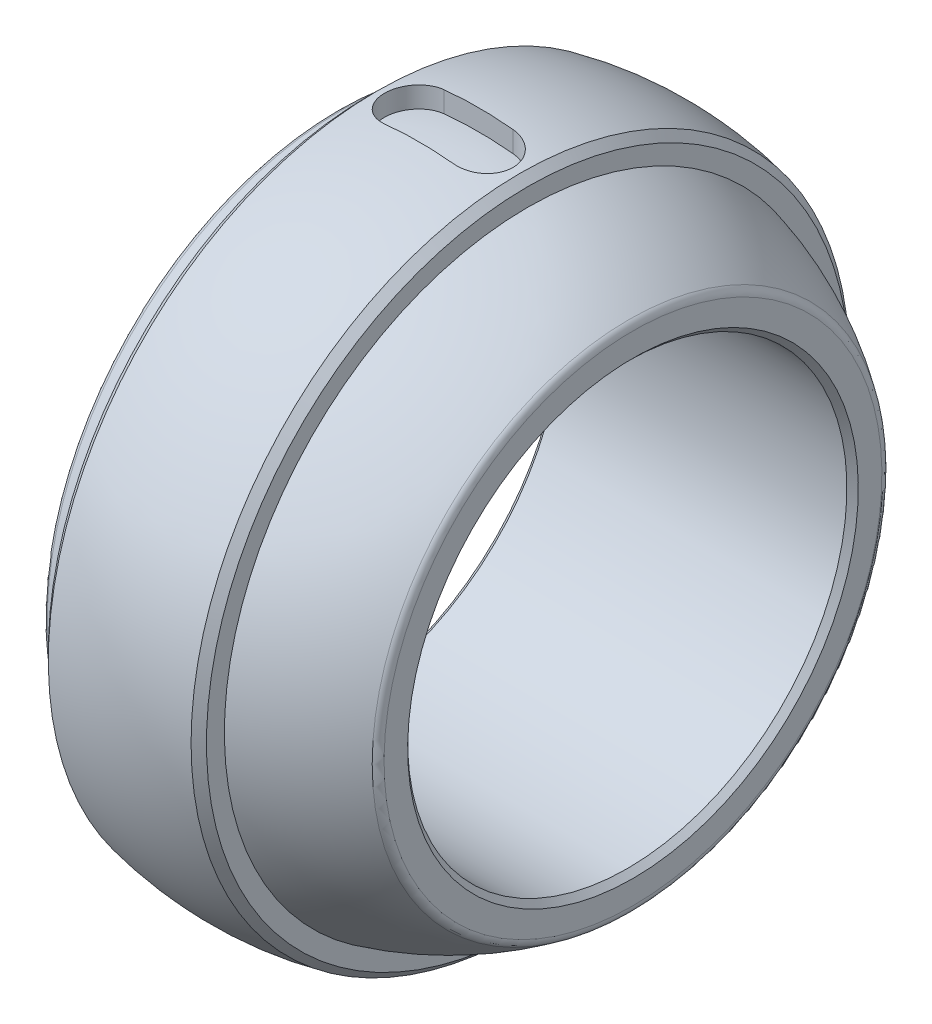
ISO-10303-21;
HEADER;
FILE_DESCRIPTION(('STEP AP214'),'2;1');
FILE_NAME('part.step','',(''),(''),'','','');
FILE_SCHEMA(('AUTOMOTIVE_DESIGN { 1 0 10303 214 1 1 1 1 }'));
ENDSEC;
DATA;
#1=APPLICATION_CONTEXT('core data for automotive mechanical design processes');
#2=APPLICATION_PROTOCOL_DEFINITION('international standard','automotive_design',2000,#1);
#3=PRODUCT_CONTEXT('',#1,'mechanical');
#4=PRODUCT('Part','Part','',(#3));
#5=PRODUCT_RELATED_PRODUCT_CATEGORY('part','',(#4));
#6=PRODUCT_DEFINITION_FORMATION('','',#4);
#7=PRODUCT_DEFINITION_CONTEXT('part definition',#1,'design');
#8=PRODUCT_DEFINITION('design','',#6,#7);
#9=PRODUCT_DEFINITION_SHAPE('','',#8);
#10=(LENGTH_UNIT() NAMED_UNIT(*) SI_UNIT(.MILLI.,.METRE.));
#11=(NAMED_UNIT(*) PLANE_ANGLE_UNIT() SI_UNIT($,.RADIAN.));
#12=(NAMED_UNIT(*) SI_UNIT($,.STERADIAN.) SOLID_ANGLE_UNIT());
#13=UNCERTAINTY_MEASURE_WITH_UNIT(LENGTH_MEASURE(1.E-05),#10,'distance_accuracy_value','');
#14=(GEOMETRIC_REPRESENTATION_CONTEXT(3) GLOBAL_UNCERTAINTY_ASSIGNED_CONTEXT((#13)) GLOBAL_UNIT_ASSIGNED_CONTEXT((#10,
#11,#12)) REPRESENTATION_CONTEXT('',''));
#15=CARTESIAN_POINT('',(0.,0.,0.));
#16=DIRECTION('',(0.,0.,1.));
#17=DIRECTION('',(1.,0.,0.));
#18=AXIS2_PLACEMENT_3D('',#15,#16,#17);
#19=CARTESIAN_POINT('',(0.,0.,0.));
#20=DIRECTION('',(-1.,0.,0.));
#21=DIRECTION('',(0.,1.,0.));
#22=AXIS2_PLACEMENT_3D('',#19,#20,#21);
#23=SPHERICAL_SURFACE('',#22,44.99991);
#24=CARTESIAN_POINT('',(9.53666015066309,0.,0.));
#25=DIRECTION('',(-1.,0.,0.));
#26=DIRECTION('',(0.,-1.,0.));
#27=AXIS2_PLACEMENT_3D('',#24,#25,#26);
#28=CIRCLE('',#27,43.9777672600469);
#29=CARTESIAN_POINT('',(9.53666015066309,-43.9777672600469,0.));
#30=VERTEX_POINT('',#29);
#31=EDGE_CURVE('E245',#30,#30,#28,.T.);
#32=ORIENTED_EDGE('',*,*,#31,.T.);
#33=EDGE_LOOP('',(#32));
#34=FACE_BOUND('',#33,.T.);
#35=CARTESIAN_POINT('',(-9.53666015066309,0.,0.));
#36=DIRECTION('',(1.,0.,0.));
#37=DIRECTION('',(0.,1.,0.));
#38=AXIS2_PLACEMENT_3D('',#35,#36,#37);
#39=CIRCLE('',#38,43.9777672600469);
#40=CARTESIAN_POINT('',(-9.53666015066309,43.9777672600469,0.));
#41=VERTEX_POINT('',#40);
#42=EDGE_CURVE('E248',#41,#41,#39,.T.);
#43=ORIENTED_EDGE('',*,*,#42,.T.);
#44=EDGE_LOOP('',(#43));
#45=FACE_BOUND('',#44,.T.);
#46=CARTESIAN_POINT('',(-4.6228,44.585542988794,3.96875));
#47=CARTESIAN_POINT('',(-2.31757744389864,44.8245287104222,3.96875));
#48=CARTESIAN_POINT('',(0.,44.8245571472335,3.96875));
#49=CARTESIAN_POINT('',(2.31702891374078,44.8245855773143,3.96875));
#50=CARTESIAN_POINT('',(4.6228,44.585542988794,3.96875));
#51=B_SPLINE_CURVE_WITH_KNOTS('',2,(#46,#47,#48,#49,#50),.UNSPECIFIED.,.F.,.F.,(3,2,3),(0.,0.5,
1.),.UNSPECIFIED.);
#52=CARTESIAN_POINT('',(-4.6228,44.585542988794,3.96875));
#53=VERTEX_POINT('',#52);
#54=CARTESIAN_POINT('',(4.6228,44.585542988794,3.96875));
#55=VERTEX_POINT('',#54);
#56=EDGE_CURVE('E35',#53,#55,#51,.T.);
#57=ORIENTED_EDGE('',*,*,#56,.F.);
#58=CARTESIAN_POINT('',(-4.6228,44.585542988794,-3.96875));
#59=CARTESIAN_POINT('',(-5.66861620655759,44.4771087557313,-3.96875));
#60=CARTESIAN_POINT('',(-6.69193026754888,44.3705549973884,-3.5415186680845));
#61=CARTESIAN_POINT('',(-8.15863813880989,44.2174802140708,-2.07882255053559));
#62=CARTESIAN_POINT('',(-8.59076220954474,44.1722135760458,-1.04077041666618));
#63=CARTESIAN_POINT('',(-8.59233551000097,44.1720489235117,1.03475358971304));
#64=CARTESIAN_POINT('',(-8.16880618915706,44.2164186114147,2.06752216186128));
#65=CARTESIAN_POINT('',(-6.6861604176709,44.3711575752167,3.54842945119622));
#66=CARTESIAN_POINT('',(-5.66862625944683,44.4771077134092,3.96875));
#67=CARTESIAN_POINT('',(-4.6228,44.585542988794,3.96875));
#68=B_SPLINE_CURVE_WITH_KNOTS('',3,(#58,#59,#60,#61,#62,#63,#64,#65,#66,#67),.UNSPECIFIED.,.F.,
.F.,(4,2,2,2,4),(0.,0.25,0.5,0.75,1.),.UNSPECIFIED.);
#69=CARTESIAN_POINT('',(-4.6228,44.585542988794,-3.96875));
#70=VERTEX_POINT('',#69);
#71=EDGE_CURVE('E94',#70,#53,#68,.T.);
#72=ORIENTED_EDGE('',*,*,#71,.F.);
#73=CARTESIAN_POINT('',(4.6228,44.585542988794,-3.96875));
#74=CARTESIAN_POINT('',(2.3175774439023,44.8245287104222,-3.96875));
#75=CARTESIAN_POINT('',(0.,44.8245571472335,-3.96875));
#76=CARTESIAN_POINT('',(-2.31702891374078,44.8245855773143,-3.96875));
#77=CARTESIAN_POINT('',(-4.6228,44.585542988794,-3.96875));
#78=B_SPLINE_CURVE_WITH_KNOTS('',2,(#73,#74,#75,#76,#77),.UNSPECIFIED.,.F.,.F.,(3,2,3),(0.,0.5,
1.),.UNSPECIFIED.);
#79=CARTESIAN_POINT('',(4.6228,44.585542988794,-3.96875));
#80=VERTEX_POINT('',#79);
#81=EDGE_CURVE('E78',#80,#70,#78,.T.);
#82=ORIENTED_EDGE('',*,*,#81,.F.);
#83=CARTESIAN_POINT('',(4.6228,44.585542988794,3.96875));
#84=CARTESIAN_POINT('',(5.66861620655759,44.4771087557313,3.96875));
#85=CARTESIAN_POINT('',(6.69193026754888,44.3705549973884,3.5415186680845));
#86=CARTESIAN_POINT('',(8.15863813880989,44.2174802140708,2.07882255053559));
#87=CARTESIAN_POINT('',(8.59076220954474,44.1722135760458,1.04077041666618));
#88=CARTESIAN_POINT('',(8.59233551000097,44.1720489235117,-1.03475358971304));
#89=CARTESIAN_POINT('',(8.16880618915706,44.2164186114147,-2.06752216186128));
#90=CARTESIAN_POINT('',(6.6861604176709,44.3711575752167,-3.54842945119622));
#91=CARTESIAN_POINT('',(5.66862625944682,44.4771077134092,-3.96875));
#92=CARTESIAN_POINT('',(4.6228,44.585542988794,-3.96875));
#93=B_SPLINE_CURVE_WITH_KNOTS('',3,(#83,#84,#85,#86,#87,#88,#89,#90,#91,#92),.UNSPECIFIED.,.F.,
.F.,(4,2,2,2,4),(0.,0.25,0.5,0.75,1.),.UNSPECIFIED.);
#94=EDGE_CURVE('E77',#55,#80,#93,.T.);
#95=ORIENTED_EDGE('',*,*,#94,.F.);
#96=EDGE_LOOP('',(#57,#72,#82,#95));
#97=FACE_BOUND('',#96,.T.);
#98=ADVANCED_FACE('F16',(#34,#45,#97),#23,.T.);
#99=CARTESIAN_POINT('',(0.,0.,0.));
#100=DIRECTION('',(-1.,0.,0.));
#101=DIRECTION('',(0.,1.,0.));
#102=AXIS2_PLACEMENT_3D('',#99,#100,#101);
#103=SPHERICAL_SURFACE('',#102,41.91);
#104=CARTESIAN_POINT('',(-14.2494,0.,0.));
#105=DIRECTION('',(1.,0.,0.));
#106=DIRECTION('',(0.,1.,0.));
#107=AXIS2_PLACEMENT_3D('',#104,#105,#106);
#108=CIRCLE('',#107,39.4132300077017);
#109=CARTESIAN_POINT('',(-14.2494,39.4132300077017,0.));
#110=VERTEX_POINT('',#109);
#111=EDGE_CURVE('E233',#110,#110,#108,.T.);
#112=CARTESIAN_POINT('',(-10.5664,0.,0.));
#113=DIRECTION('',(-1.,0.,0.));
#114=DIRECTION('',(0.,-1.,0.));
#115=AXIS2_PLACEMENT_3D('',#112,#113,#114);
#116=CIRCLE('',#115,40.556125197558);
#117=CARTESIAN_POINT('',(-10.5664,40.556125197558,0.));
#118=VERTEX_POINT('',#117);
#119=EDGE_CURVE('E219',#118,#118,#116,.T.);
#120=CARTESIAN_POINT('',(-14.2494,39.4132300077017,0.));
#121=CARTESIAN_POINT('',(-14.2116104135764,39.4268923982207,0.));
#122=CARTESIAN_POINT('',(-14.1738011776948,39.4405004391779,0.));
#123=CARTESIAN_POINT('',(-14.098143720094,39.467607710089,0.));
#124=CARTESIAN_POINT('',(-14.0602954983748,39.4811069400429,0.));
#125=CARTESIAN_POINT('',(-13.9845603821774,39.5079964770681,0.));
#126=CARTESIAN_POINT('',(-13.9466734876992,39.5213867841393,0.));
#127=CARTESIAN_POINT('',(-13.8708613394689,39.5480583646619,0.));
#128=CARTESIAN_POINT('',(-13.8329360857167,39.5613396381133,0.));
#129=CARTESIAN_POINT('',(-13.7570475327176,39.5877930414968,0.));
#130=CARTESIAN_POINT('',(-13.7190842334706,39.6009651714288,0.));
#131=CARTESIAN_POINT('',(-13.6431199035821,39.6272001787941,0.));
#132=CARTESIAN_POINT('',(-13.6051188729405,39.6402630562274,0.));
#133=CARTESIAN_POINT('',(-13.5290793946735,39.6662794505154,0.));
#134=CARTESIAN_POINT('',(-13.4910409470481,39.6792329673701,0.));
#135=CARTESIAN_POINT('',(-13.414926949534,39.7050305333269,0.));
#136=CARTESIAN_POINT('',(-13.3768513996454,39.717874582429,0.));
#137=CARTESIAN_POINT('',(-13.3006635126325,39.7434531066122,0.));
#138=CARTESIAN_POINT('',(-13.2625511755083,39.7561875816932,0.));
#139=CARTESIAN_POINT('',(-13.1862900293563,39.7815468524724,0.));
#140=CARTESIAN_POINT('',(-13.1481412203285,39.7941716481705,0.));
#141=CARTESIAN_POINT('',(-13.071807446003,39.8193114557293,0.));
#142=CARTESIAN_POINT('',(-13.0336224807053,39.8318264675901,0.));
#143=CARTESIAN_POINT('',(-12.957216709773,39.8567466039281,0.));
#144=CARTESIAN_POINT('',(-12.9189959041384,39.8691517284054,0.));
#145=CARTESIAN_POINT('',(-12.8425187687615,39.8938519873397,0.));
#146=CARTESIAN_POINT('',(-12.8042624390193,39.9061471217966,0.));
#147=CARTESIAN_POINT('',(-12.7277145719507,39.9306272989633,0.));
#148=CARTESIAN_POINT('',(-12.6894230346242,39.942812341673,0.));
#149=CARTESIAN_POINT('',(-12.6128050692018,39.9670722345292,0.));
#150=CARTESIAN_POINT('',(-12.5744786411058,39.9791470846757,0.));
#151=CARTESIAN_POINT('',(-12.4977912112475,40.0031864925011,0.));
#152=CARTESIAN_POINT('',(-12.4594302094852,40.01515105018,0.));
#153=CARTESIAN_POINT('',(-12.3826739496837,40.0389697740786,0.));
#154=CARTESIAN_POINT('',(-12.3442786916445,40.0508239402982,0.));
#155=CARTESIAN_POINT('',(-12.267454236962,40.0744217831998,0.));
#156=CARTESIAN_POINT('',(-12.2290250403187,40.0861654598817,0.));
#157=CARTESIAN_POINT('',(-12.1521330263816,40.1095422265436,0.));
#158=CARTESIAN_POINT('',(-12.1136702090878,40.1211753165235,0.));
#159=CARTESIAN_POINT('',(-12.0367112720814,40.1443308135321,0.));
#160=CARTESIAN_POINT('',(-11.9982151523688,40.1558532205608,0.));
#161=CARTESIAN_POINT('',(-11.9211899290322,40.1787872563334,0.));
#162=CARTESIAN_POINT('',(-11.8826608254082,40.1901988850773,0.));
#163=CARTESIAN_POINT('',(-11.8055699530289,40.2129112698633,0.));
#164=CARTESIAN_POINT('',(-11.7670081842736,40.2242120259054,0.));
#165=CARTESIAN_POINT('',(-11.6898523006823,40.2467025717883,0.));
#166=CARTESIAN_POINT('',(-11.6512581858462,40.257892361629,0.));
#167=CARTESIAN_POINT('',(-11.5740379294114,40.2801608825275,0.));
#168=CARTESIAN_POINT('',(-11.5354117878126,40.2912396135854,0.));
#169=CARTESIAN_POINT('',(-11.4581277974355,40.3132859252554,0.));
#170=CARTESIAN_POINT('',(-11.4194699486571,40.3242535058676,0.));
#171=CARTESIAN_POINT('',(-11.3421228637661,40.3460774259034,0.));
#172=CARTESIAN_POINT('',(-11.3034336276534,40.3569337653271,0.));
#173=CARTESIAN_POINT('',(-11.226024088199,40.3785351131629,0.));
#174=CARTESIAN_POINT('',(-11.1873037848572,40.389280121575,0.));
#175=CARTESIAN_POINT('',(-11.1098324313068,40.4106587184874,0.));
#176=CARTESIAN_POINT('',(-11.0710813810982,40.4212923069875,0.));
#177=CARTESIAN_POINT('',(-10.9935488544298,40.4424479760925,0.));
#178=CARTESIAN_POINT('',(-10.95476737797,40.4529700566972,0.));
#179=CARTESIAN_POINT('',(-10.877174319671,40.4739026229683,0.));
#180=CARTESIAN_POINT('',(-10.8383627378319,40.4843131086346,0.));
#181=CARTESIAN_POINT('',(-10.760709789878,40.5050223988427,0.));
#182=CARTESIAN_POINT('',(-10.7218684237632,40.5153212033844,0.));
#183=CARTESIAN_POINT('',(-10.6441562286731,40.535807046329,0.));
#184=CARTESIAN_POINT('',(-10.6052853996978,40.5459940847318,0.));
#185=CARTESIAN_POINT('',(-10.5664,40.556125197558,0.));
#186=B_SPLINE_CURVE_WITH_KNOTS('',3,(#120,#121,#122,#123,#124,#125,#126,#127,#128,#129,#130,
#131,#132,#133,#134,#135,#136,#137,#138,#139,#140,#141,#142,#143,#144,#145,#146,#147,#148,#149,
#150,#151,#152,#153,#154,#155,#156,#157,#158,#159,#160,#161,#162,#163,#164,#165,#166,#167,#168,
#169,#170,#171,#172,#173,#174,#175,#176,#177,#178,#179,#180,#181,#182,#183,#184,#185),
.UNSPECIFIED.,.F.,.F.,(4,2,2,2,2,2,2,2,2,2,2,2,2,2,2,2,2,2,2,2,2,2,2,2,2,2,2,2,2,2,2,2,4),(0.,
0.120550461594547,0.241100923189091,0.361651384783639,0.482201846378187,0.602752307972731,
0.72330276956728,0.843853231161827,0.964403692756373,1.08495415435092,1.20550461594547,
1.32605507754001,1.44660553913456,1.5671560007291,1.68770646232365,1.8082569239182,
1.92880738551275,2.04935784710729,2.16990830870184,2.29045877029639,2.41100923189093,
2.53155969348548,2.65211015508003,2.77266061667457,2.89321107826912,3.01376153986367,
3.13431200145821,3.25486246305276,3.37541292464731,3.49596338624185,3.6165138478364,
3.73706430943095,3.85761477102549),.UNSPECIFIED.);
#187=EDGE_CURVE('BSEAM18',#110,#118,#186,.T.);
#188=ORIENTED_EDGE('',*,*,#111,.T.);
#189=ORIENTED_EDGE('',*,*,#119,.T.);
#190=ORIENTED_EDGE('',*,*,#187,.T.);
#191=ORIENTED_EDGE('',*,*,#187,.F.);
#192=EDGE_LOOP('',(#188,#190,#189,#191));
#193=FACE_BOUND('',#192,.T.);
#194=ADVANCED_FACE('F18',(#193),#103,.T.);
#195=CARTESIAN_POINT('',(-15.0876,39.1000310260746,0.));
#196=DIRECTION('',(1.,0.,0.));
#197=DIRECTION('',(0.,1.,0.));
#198=AXIS2_PLACEMENT_3D('',#195,#196,#197);
#199=PLANE('',#198);
#200=CARTESIAN_POINT('',(-15.0876,0.,0.));
#201=DIRECTION('',(1.,0.,0.));
#202=DIRECTION('',(0.,1.,0.));
#203=AXIS2_PLACEMENT_3D('',#200,#201,#202);
#204=CIRCLE('',#203,30.1117);
#205=CARTESIAN_POINT('',(-15.0876,30.1117,0.));
#206=VERTEX_POINT('',#205);
#207=EDGE_CURVE('E27',#206,#206,#204,.T.);
#208=ORIENTED_EDGE('',*,*,#207,.T.);
#209=EDGE_LOOP('',(#208));
#210=FACE_BOUND('',#209,.T.);
#211=CARTESIAN_POINT('',(-15.0876,0.,0.));
#212=DIRECTION('',(1.,0.,0.));
#213=DIRECTION('',(0.,1.,0.));
#214=AXIS2_PLACEMENT_3D('',#211,#212,#213);
#215=CIRCLE('',#214,38.218889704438);
#216=CARTESIAN_POINT('',(-15.0876,38.218889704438,0.));
#217=VERTEX_POINT('',#216);
#218=EDGE_CURVE('E230',#217,#217,#215,.F.);
#219=ORIENTED_EDGE('',*,*,#218,.T.);
#220=EDGE_LOOP('',(#219));
#221=FACE_BOUND('',#220,.T.);
#222=ADVANCED_FACE('F404',(#210,#221),#199,.F.);
#223=CARTESIAN_POINT('',(24.6126,0.,0.));
#224=DIRECTION('',(-1.,0.,0.));
#225=DIRECTION('',(0.,-1.,0.));
#226=AXIS2_PLACEMENT_3D('',#223,#224,#225);
#227=PLANE('',#226);
#228=CARTESIAN_POINT('',(24.6126,0.,0.));
#229=DIRECTION('',(-1.,0.,0.));
#230=DIRECTION('',(0.,-1.,0.));
#231=AXIS2_PLACEMENT_3D('',#228,#229,#230);
#232=CIRCLE('',#231,30.1117);
#233=CARTESIAN_POINT('',(24.6126,-30.1117,0.));
#234=VERTEX_POINT('',#233);
#235=EDGE_CURVE('E10',#234,#234,#232,.T.);
#236=ORIENTED_EDGE('',*,*,#235,.T.);
#237=EDGE_LOOP('',(#236));
#238=FACE_BOUND('',#237,.T.);
#239=CARTESIAN_POINT('',(24.6126,0.,0.));
#240=DIRECTION('',(-1.,0.,0.));
#241=DIRECTION('',(0.,-1.,0.));
#242=AXIS2_PLACEMENT_3D('',#239,#240,#241);
#243=CIRCLE('',#242,33.2675912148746);
#244=CARTESIAN_POINT('',(24.6126,-33.2675912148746,0.));
#245=VERTEX_POINT('',#244);
#246=EDGE_CURVE('E239',#245,#245,#243,.F.);
#247=ORIENTED_EDGE('',*,*,#246,.T.);
#248=EDGE_LOOP('',(#247));
#249=FACE_BOUND('',#248,.T.);
#250=ADVANCED_FACE('F396',(#238,#249),#227,.F.);
#251=CARTESIAN_POINT('',(0.,0.,0.));
#252=DIRECTION('',(-1.,0.,0.));
#253=DIRECTION('',(0.,1.,0.));
#254=AXIS2_PLACEMENT_3D('',#251,#252,#253);
#255=SPHERICAL_SURFACE('',#254,41.91);
#256=CARTESIAN_POINT('',(24.07205625,0.,0.));
#257=DIRECTION('',(-1.,0.,0.));
#258=DIRECTION('',(0.,-1.,0.));
#259=AXIS2_PLACEMENT_3D('',#256,#257,#258);
#260=CIRCLE('',#259,34.3072034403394);
#261=CARTESIAN_POINT('',(24.07205625,34.3072034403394,0.));
#262=VERTEX_POINT('',#261);
#263=EDGE_CURVE('E236',#262,#262,#260,.T.);
#264=CARTESIAN_POINT('',(10.5664,0.,0.));
#265=DIRECTION('',(-1.,0.,0.));
#266=DIRECTION('',(0.,-1.,0.));
#267=AXIS2_PLACEMENT_3D('',#264,#265,#266);
#268=CIRCLE('',#267,40.556125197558);
#269=CARTESIAN_POINT('',(10.5664,40.556125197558,0.));
#270=VERTEX_POINT('',#269);
#271=EDGE_CURVE('E227',#270,#270,#268,.T.);
#272=CARTESIAN_POINT('',(24.07205625,34.3072034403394,0.));
#273=CARTESIAN_POINT('',(23.9444875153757,34.396713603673,0.));
#274=CARTESIAN_POINT('',(23.8164194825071,34.4855121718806,0.));
#275=CARTESIAN_POINT('',(23.5593008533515,34.6616752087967,0.));
#276=CARTESIAN_POINT('',(23.4302502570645,34.7490396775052,0.));
#277=CARTESIAN_POINT('',(23.1711825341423,34.9223236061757,0.));
#278=CARTESIAN_POINT('',(23.0411654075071,35.0082430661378,0.));
#279=CARTESIAN_POINT('',(22.7801808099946,35.1786262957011,0.));
#280=CARTESIAN_POINT('',(22.6492133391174,35.2630900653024,0.));
#281=CARTESIAN_POINT('',(22.3863443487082,35.4305514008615,0.));
#282=CARTESIAN_POINT('',(22.2544428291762,35.5135489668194,0.));
#283=CARTESIAN_POINT('',(21.9897221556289,35.678067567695,0.));
#284=CARTESIAN_POINT('',(21.8569030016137,35.7595886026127,0.));
#285=CARTESIAN_POINT('',(21.5903635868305,35.921143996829,0.));
#286=CARTESIAN_POINT('',(21.4566433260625,36.0011783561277,0.));
#287=CARTESIAN_POINT('',(21.1883183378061,36.1597504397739,0.));
#288=CARTESIAN_POINT('',(21.0537136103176,36.2382881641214,0.));
#289=CARTESIAN_POINT('',(20.7836364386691,36.3938572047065,0.));
#290=CARTESIAN_POINT('',(20.648163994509,36.4708885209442,0.));
#291=CARTESIAN_POINT('',(20.376368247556,36.6234351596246,0.));
#292=CARTESIAN_POINT('',(20.2400449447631,36.6989504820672,0.));
#293=CARTESIAN_POINT('',(19.9665644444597,36.848455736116,0.));
#294=CARTESIAN_POINT('',(19.8294072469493,36.9224456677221,0.));
#295=CARTESIAN_POINT('',(19.5542760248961,37.0688909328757,0.));
#296=CARTESIAN_POINT('',(19.4163020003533,37.141346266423,0.));
#297=CARTESIAN_POINT('',(19.1395542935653,37.2847133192,0.));
#298=CARTESIAN_POINT('',(19.00078061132,37.3556250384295,0.));
#299=CARTESIAN_POINT('',(18.7224508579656,37.4958960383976,0.));
#300=CARTESIAN_POINT('',(18.5828947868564,37.5652553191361,0.));
#301=CARTESIAN_POINT('',(18.3030176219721,37.7024128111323,0.));
#302=CARTESIAN_POINT('',(18.162696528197,37.7702110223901,0.));
#303=CARTESIAN_POINT('',(17.8813067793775,37.9042379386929,0.));
#304=CARTESIAN_POINT('',(17.740238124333,37.970466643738,0.));
#305=CARTESIAN_POINT('',(17.4573708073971,38.1013463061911,0.));
#306=CARTESIAN_POINT('',(17.3155721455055,38.1659972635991,0.));
#307=CARTESIAN_POINT('',(17.0312624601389,38.2937133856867,0.));
#308=CARTESIAN_POINT('',(16.8887514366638,38.3567785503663,0.));
#309=CARTESIAN_POINT('',(16.6030347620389,38.4813152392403,0.));
#310=CARTESIAN_POINT('',(16.4598291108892,38.5427867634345,0.));
#311=CARTESIAN_POINT('',(16.1727410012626,38.6641285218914,0.));
#312=CARTESIAN_POINT('',(16.0288585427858,38.7239987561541,0.));
#313=CARTESIAN_POINT('',(15.7404347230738,38.8421304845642,0.));
#314=CARTESIAN_POINT('',(15.5958933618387,38.9003919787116,0.));
#315=CARTESIAN_POINT('',(15.3061697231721,39.0152989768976,0.));
#316=CARTESIAN_POINT('',(15.1609874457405,39.0719444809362,0.));
#317=CARTESIAN_POINT('',(14.8700000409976,39.1836124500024,0.));
#318=CARTESIAN_POINT('',(14.7241949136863,39.23863491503,0.));
#319=CARTESIAN_POINT('',(14.4319799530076,39.3470499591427,0.));
#320=CARTESIAN_POINT('',(14.2855701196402,39.4004425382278,0.));
#321=CARTESIAN_POINT('',(13.9921639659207,39.5055911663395,0.));
#322=CARTESIAN_POINT('',(13.8451676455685,39.5573472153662,0.));
#323=CARTESIAN_POINT('',(13.550606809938,39.6592163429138,0.));
#324=CARTESIAN_POINT('',(13.4030422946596,39.7093294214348,0.));
#325=CARTESIAN_POINT('',(13.1073634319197,39.8079063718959,0.));
#326=CARTESIAN_POINT('',(12.9592490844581,39.856370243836,0.));
#327=CARTESIAN_POINT('',(12.6624889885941,39.9516427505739,0.));
#328=CARTESIAN_POINT('',(12.5138432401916,39.9984513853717,0.));
#329=CARTESIAN_POINT('',(12.2160388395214,40.0904075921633,0.));
#330=CARTESIAN_POINT('',(12.0668801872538,40.1355551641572,0.));
#331=CARTESIAN_POINT('',(11.7680685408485,40.2241836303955,0.));
#332=CARTESIAN_POINT('',(11.6184155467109,40.2676645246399,0.));
#333=CARTESIAN_POINT('',(11.318633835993,40.3529542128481,0.));
#334=CARTESIAN_POINT('',(11.1685051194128,40.3947630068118,0.));
#335=CARTESIAN_POINT('',(10.8677906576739,40.4767033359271,0.));
#336=CARTESIAN_POINT('',(10.7172049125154,40.5168348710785,0.));
#337=CARTESIAN_POINT('',(10.5664,40.556125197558,0.));
#338=B_SPLINE_CURVE_WITH_KNOTS('',3,(#272,#273,#274,#275,#276,#277,#278,#279,#280,#281,#282,
#283,#284,#285,#286,#287,#288,#289,#290,#291,#292,#293,#294,#295,#296,#297,#298,#299,#300,#301,
#302,#303,#304,#305,#306,#307,#308,#309,#310,#311,#312,#313,#314,#315,#316,#317,#318,#319,#320,
#321,#322,#323,#324,#325,#326,#327,#328,#329,#330,#331,#332,#333,#334,#335,#336,#337),
.UNSPECIFIED.,.F.,.F.,(4,2,2,2,2,2,2,2,2,2,2,2,2,2,2,2,2,2,2,2,2,2,2,2,2,2,2,2,2,2,2,2,4),(0.,
0.467515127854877,0.935030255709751,1.40254538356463,1.87006051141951,2.33757563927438,
2.80509076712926,3.27260589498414,3.74012102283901,4.20763615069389,4.67515127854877,
5.14266640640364,5.61018153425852,6.0776966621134,6.54521178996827,7.01272691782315,
7.48024204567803,7.9477571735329,8.41527230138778,8.88278742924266,9.35030255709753,
9.81781768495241,10.2853328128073,10.7528479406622,11.220363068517,11.6878781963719,
12.1553933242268,12.6229084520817,13.0904235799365,13.5579387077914,14.0254538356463,
14.4929689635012,14.9604840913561),.UNSPECIFIED.);
#339=EDGE_CURVE('BSEAM388',#262,#270,#338,.T.);
#340=ORIENTED_EDGE('',*,*,#263,.T.);
#341=ORIENTED_EDGE('',*,*,#271,.F.);
#342=ORIENTED_EDGE('',*,*,#339,.T.);
#343=ORIENTED_EDGE('',*,*,#339,.F.);
#344=EDGE_LOOP('',(#340,#342,#341,#343));
#345=FACE_BOUND('',#344,.T.);
#346=ADVANCED_FACE('F388',(#345),#255,.T.);
#347=CARTESIAN_POINT('',(10.5664,43.74177741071,0.));
#348=DIRECTION('',(-1.,0.,0.));
#349=DIRECTION('',(0.,-1.,0.));
#350=AXIS2_PLACEMENT_3D('',#347,#348,#349);
#351=PLANE('',#350);
#352=CARTESIAN_POINT('',(10.5664,0.,0.));
#353=DIRECTION('',(-1.,0.,0.));
#354=DIRECTION('',(0.,-1.,0.));
#355=AXIS2_PLACEMENT_3D('',#352,#353,#354);
#356=CIRCLE('',#355,42.94802741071);
#357=CARTESIAN_POINT('',(10.5664,-42.94802741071,0.));
#358=VERTEX_POINT('',#357);
#359=EDGE_CURVE('E251',#358,#358,#356,.F.);
#360=ORIENTED_EDGE('',*,*,#359,.T.);
#361=EDGE_LOOP('',(#360));
#362=FACE_BOUND('',#361,.T.);
#363=ORIENTED_EDGE('',*,*,#271,.T.);
#364=EDGE_LOOP('',(#363));
#365=FACE_BOUND('',#364,.T.);
#366=ADVANCED_FACE('F280',(#362,#365),#351,.F.);
#367=CARTESIAN_POINT('',(-10.5664,43.74177741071,0.));
#368=DIRECTION('',(1.,0.,0.));
#369=DIRECTION('',(0.,1.,0.));
#370=AXIS2_PLACEMENT_3D('',#367,#368,#369);
#371=PLANE('',#370);
#372=CARTESIAN_POINT('',(-10.5664,0.,0.));
#373=DIRECTION('',(1.,0.,0.));
#374=DIRECTION('',(0.,1.,0.));
#375=AXIS2_PLACEMENT_3D('',#372,#373,#374);
#376=CIRCLE('',#375,42.94802741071);
#377=CARTESIAN_POINT('',(-10.5664,42.94802741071,0.));
#378=VERTEX_POINT('',#377);
#379=EDGE_CURVE('E242',#378,#378,#376,.F.);
#380=ORIENTED_EDGE('',*,*,#379,.T.);
#381=EDGE_LOOP('',(#380));
#382=FACE_BOUND('',#381,.T.);
#383=ORIENTED_EDGE('',*,*,#119,.F.);
#384=EDGE_LOOP('',(#383));
#385=FACE_BOUND('',#384,.T.);
#386=ADVANCED_FACE('F278',(#382,#385),#371,.F.);
#387=CARTESIAN_POINT('',(-13.8176,0.,0.));
#388=DIRECTION('',(1.,0.,0.));
#389=DIRECTION('',(0.,1.,0.));
#390=AXIS2_PLACEMENT_3D('',#387,#388,#389);
#391=TOROIDAL_SURFACE('',#390,38.218889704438,1.27);
#392=ORIENTED_EDGE('',*,*,#111,.F.);
#393=EDGE_LOOP('',(#392));
#394=FACE_BOUND('',#393,.T.);
#395=ORIENTED_EDGE('',*,*,#218,.F.);
#396=EDGE_LOOP('',(#395));
#397=FACE_BOUND('',#396,.T.);
#398=ADVANCED_FACE('F365',(#394,#397),#391,.T.);
#399=CARTESIAN_POINT('',(23.3426,0.,0.));
#400=DIRECTION('',(-1.,0.,0.));
#401=DIRECTION('',(0.,-1.,0.));
#402=AXIS2_PLACEMENT_3D('',#399,#400,#401);
#403=TOROIDAL_SURFACE('',#402,33.2675912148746,1.27);
#404=ORIENTED_EDGE('',*,*,#246,.F.);
#405=EDGE_LOOP('',(#404));
#406=FACE_BOUND('',#405,.T.);
#407=ORIENTED_EDGE('',*,*,#263,.F.);
#408=EDGE_LOOP('',(#407));
#409=FACE_BOUND('',#408,.T.);
#410=ADVANCED_FACE('F356',(#406,#409),#403,.T.);
#411=CARTESIAN_POINT('',(-10.5664,0.,0.));
#412=DIRECTION('',(1.,0.,0.));
#413=DIRECTION('',(0.,1.,0.));
#414=AXIS2_PLACEMENT_3D('',#411,#412,#413);
#415=CONICAL_SURFACE('',#414,42.94802741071,0.785398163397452);
#416=ORIENTED_EDGE('',*,*,#42,.F.);
#417=EDGE_LOOP('',(#416));
#418=FACE_BOUND('',#417,.T.);
#419=ORIENTED_EDGE('',*,*,#379,.F.);
#420=EDGE_LOOP('',(#419));
#421=FACE_BOUND('',#420,.T.);
#422=ADVANCED_FACE('F347',(#418,#421),#415,.T.);
#423=CARTESIAN_POINT('',(9.53666015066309,0.,0.));
#424=DIRECTION('',(-1.,0.,0.));
#425=DIRECTION('',(0.,-1.,0.));
#426=AXIS2_PLACEMENT_3D('',#423,#424,#425);
#427=CONICAL_SURFACE('',#426,43.9777672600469,0.785398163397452);
#428=ORIENTED_EDGE('',*,*,#359,.F.);
#429=EDGE_LOOP('',(#428));
#430=FACE_BOUND('',#429,.T.);
#431=ORIENTED_EDGE('',*,*,#31,.F.);
#432=EDGE_LOOP('',(#431));
#433=FACE_BOUND('',#432,.T.);
#434=ADVANCED_FACE('F338',(#430,#433),#427,.T.);
#435=CARTESIAN_POINT('',(-15.0886,0.,0.));
#436=DIRECTION('',(1.,0.,0.));
#437=DIRECTION('',(0.,1.,0.));
#438=AXIS2_PLACEMENT_3D('',#435,#436,#437);
#439=CYLINDRICAL_SURFACE('',#438,29.3497);
#440=CARTESIAN_POINT('',(-14.3256,0.,0.));
#441=DIRECTION('',(1.,0.,0.));
#442=DIRECTION('',(0.,1.,0.));
#443=AXIS2_PLACEMENT_3D('',#440,#441,#442);
#444=CIRCLE('',#443,29.3497);
#445=CARTESIAN_POINT('',(-14.3256,29.3497,0.));
#446=VERTEX_POINT('',#445);
#447=EDGE_CURVE('E257',#446,#446,#444,.F.);
#448=ORIENTED_EDGE('',*,*,#447,.T.);
#449=EDGE_LOOP('',(#448));
#450=FACE_BOUND('',#449,.T.);
#451=CARTESIAN_POINT('',(23.8506,0.,0.));
#452=DIRECTION('',(-1.,0.,0.));
#453=DIRECTION('',(0.,-1.,0.));
#454=AXIS2_PLACEMENT_3D('',#451,#452,#453);
#455=CIRCLE('',#454,29.3497);
#456=CARTESIAN_POINT('',(23.8506,-29.3497,0.));
#457=VERTEX_POINT('',#456);
#458=EDGE_CURVE('E254',#457,#457,#455,.F.);
#459=ORIENTED_EDGE('',*,*,#458,.T.);
#460=EDGE_LOOP('',(#459));
#461=FACE_BOUND('',#460,.T.);
#462=ADVANCED_FACE('F329',(#450,#461),#439,.F.);
#463=CARTESIAN_POINT('',(-14.3256,0.,0.));
#464=DIRECTION('',(-1.,0.,0.));
#465=DIRECTION('',(0.,-1.,0.));
#466=AXIS2_PLACEMENT_3D('',#463,#464,#465);
#467=CONICAL_SURFACE('',#466,29.3497,0.785398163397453);
#468=ORIENTED_EDGE('',*,*,#207,.F.);
#469=EDGE_LOOP('',(#468));
#470=FACE_BOUND('',#469,.T.);
#471=ORIENTED_EDGE('',*,*,#447,.F.);
#472=EDGE_LOOP('',(#471));
#473=FACE_BOUND('',#472,.T.);
#474=ADVANCED_FACE('F321',(#470,#473),#467,.F.);
#475=CARTESIAN_POINT('',(23.8506,0.,0.));
#476=DIRECTION('',(1.,0.,0.));
#477=DIRECTION('',(0.,1.,0.));
#478=AXIS2_PLACEMENT_3D('',#475,#476,#477);
#479=CONICAL_SURFACE('',#478,29.3497,0.785398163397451);
#480=ORIENTED_EDGE('',*,*,#235,.F.);
#481=EDGE_LOOP('',(#480));
#482=FACE_BOUND('',#481,.T.);
#483=ORIENTED_EDGE('',*,*,#458,.F.);
#484=EDGE_LOOP('',(#483));
#485=FACE_BOUND('',#484,.T.);
#486=ADVANCED_FACE('F146',(#482,#485),#479,.F.);
#487=CARTESIAN_POINT('',(0.,-2.794,0.));
#488=DIRECTION('',(-1.,0.,0.));
#489=DIRECTION('',(0.,1.,0.));
#490=AXIS2_PLACEMENT_3D('',#487,#488,#489);
#491=SPHERICAL_SURFACE('',#490,44.99991);
#492=CARTESIAN_POINT('',(-4.6228,41.791542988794,3.96875));
#493=CARTESIAN_POINT('',(-4.24020748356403,41.8312128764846,3.96874952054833));
#494=CARTESIAN_POINT('',(-3.8571041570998,41.8659559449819,3.96874812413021));
#495=CARTESIAN_POINT('',(-3.08928350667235,41.9256362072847,3.96874554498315));
#496=CARTESIAN_POINT('',(-2.70456448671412,41.9505515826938,3.9687443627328));
#497=CARTESIAN_POINT('',(-1.93376161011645,41.990492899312,3.96874427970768));
#498=CARTESIAN_POINT('',(-1.54767661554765,42.0054968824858,3.96874538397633));
#499=CARTESIAN_POINT('',(-0.774394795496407,42.0255400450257,3.96874825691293));
#500=CARTESIAN_POINT('',(-0.387197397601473,42.0305571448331,3.96875002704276));
#501=CARTESIAN_POINT('',(0.387191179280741,42.0305571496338,3.96874997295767));
#502=CARTESIAN_POINT('',(0.774382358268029,42.0255402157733,3.96874814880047));
#503=CARTESIAN_POINT('',(1.54765589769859,42.00549759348,3.96874523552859));
#504=CARTESIAN_POINT('',(1.93373882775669,41.9904938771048,3.96874414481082));
#505=CARTESIAN_POINT('',(2.70454172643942,41.9505529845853,3.96874426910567));
#506=CARTESIAN_POINT('',(3.08926282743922,41.9256376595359,3.96874547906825));
#507=CARTESIAN_POINT('',(3.85709176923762,41.8659570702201,3.96874810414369));
#508=CARTESIAN_POINT('',(4.24020129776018,41.8312135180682,3.96874951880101));
#509=CARTESIAN_POINT('',(4.6228,41.791542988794,3.96875));
#510=B_SPLINE_CURVE_WITH_KNOTS('',3,(#492,#493,#494,#495,#496,#497,#498,#499,#500,#501,#502,
#503,#504,#505,#506,#507,#508,#509),.UNSPECIFIED.,.F.,.F.,(4,2,2,2,2,2,2,2,4),(0.,
1.15389906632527,2.31034566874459,3.46934578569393,4.63090545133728,5.79244646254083,
6.9514403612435,8.10789318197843,9.26181090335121),.UNSPECIFIED.);
#511=CARTESIAN_POINT('',(-4.6228,41.791542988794,3.96875));
#512=VERTEX_POINT('',#511);
#513=CARTESIAN_POINT('',(4.6228,41.791542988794,3.96875));
#514=VERTEX_POINT('',#513);
#515=EDGE_CURVE('E73',#512,#514,#510,.T.);
#516=ORIENTED_EDGE('',*,*,#515,.T.);
#517=CARTESIAN_POINT('',(4.6228,41.791542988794,-3.96875));
#518=CARTESIAN_POINT('',(5.66862625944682,41.6831077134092,-3.96875));
#519=CARTESIAN_POINT('',(6.6861604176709,41.5771575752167,-3.54842945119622));
#520=CARTESIAN_POINT('',(8.16880618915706,41.4224186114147,-2.06752216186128));
#521=CARTESIAN_POINT('',(8.59233551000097,41.3780489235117,-1.03475358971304));
#522=CARTESIAN_POINT('',(8.59076220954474,41.3782135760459,1.04077041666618));
#523=CARTESIAN_POINT('',(8.15863813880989,41.4234802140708,2.07882255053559));
#524=CARTESIAN_POINT('',(6.69193026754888,41.5765549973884,3.5415186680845));
#525=CARTESIAN_POINT('',(5.66861620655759,41.6831087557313,3.96875));
#526=CARTESIAN_POINT('',(4.6228,41.791542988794,3.96875));
#527=B_SPLINE_CURVE_WITH_KNOTS('',3,(#517,#518,#519,#520,#521,#522,#523,#524,#525,#526),
.UNSPECIFIED.,.F.,.F.,(4,2,2,2,4),(0.,0.25,0.5,0.75,1.),.UNSPECIFIED.);
#528=CARTESIAN_POINT('',(4.6228,41.791542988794,-3.96875));
#529=VERTEX_POINT('',#528);
#530=EDGE_CURVE('E69',#514,#529,#527,.F.);
#531=ORIENTED_EDGE('',*,*,#530,.T.);
#532=CARTESIAN_POINT('',(4.6228,41.791542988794,-3.96875));
#533=CARTESIAN_POINT('',(4.24020749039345,41.8312128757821,-3.96874952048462));
#534=CARTESIAN_POINT('',(3.8571041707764,41.8659559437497,-3.9687481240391));
#535=CARTESIAN_POINT('',(3.08928352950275,41.925636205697,-3.96874554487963));
#536=CARTESIAN_POINT('',(2.70456451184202,41.9505515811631,-3.96874436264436));
#537=CARTESIAN_POINT('',(1.93376163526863,41.9904928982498,-3.96874427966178));
#538=CARTESIAN_POINT('',(1.54767663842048,42.005496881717,-3.96874538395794));
#539=CARTESIAN_POINT('',(0.774394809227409,42.0255400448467,-3.96874825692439));
#540=CARTESIAN_POINT('',(0.387197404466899,42.0305571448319,-3.96875002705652));
#541=CARTESIAN_POINT('',(-0.387191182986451,42.030557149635,-3.96874997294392));
#542=CARTESIAN_POINT('',(-0.774382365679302,42.0255402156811,-3.96874814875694));
#543=CARTESIAN_POINT('',(-1.54765591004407,42.0054975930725,-3.9687452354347));
#544=CARTESIAN_POINT('',(-1.93373884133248,41.9904938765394,-3.96874414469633));
#545=CARTESIAN_POINT('',(-2.70454174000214,41.9505529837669,-3.96874426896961));
#546=CARTESIAN_POINT('',(-3.08926283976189,41.9256376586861,-3.96874547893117));
#547=CARTESIAN_POINT('',(-3.85709177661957,41.8659570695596,-3.96874810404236));
#548=CARTESIAN_POINT('',(-4.2402013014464,41.8312135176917,-3.96874951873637));
#549=CARTESIAN_POINT('',(-4.6228,41.791542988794,-3.96875));
#550=B_SPLINE_CURVE_WITH_KNOTS('',3,(#532,#533,#534,#535,#536,#537,#538,#539,#540,#541,#542,
#543,#544,#545,#546,#547,#548,#549),.UNSPECIFIED.,.F.,.F.,(4,2,2,2,2,2,2,2,4),(0.,
1.1538990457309,2.31034564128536,3.4693457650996,4.63090545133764,5.792446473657,
6.95144037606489,8.10789319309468,9.26181090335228),.UNSPECIFIED.);
#551=CARTESIAN_POINT('',(-4.6228,41.791542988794,-3.96875));
#552=VERTEX_POINT('',#551);
#553=EDGE_CURVE('E64',#529,#552,#550,.T.);
#554=ORIENTED_EDGE('',*,*,#553,.T.);
#555=CARTESIAN_POINT('',(-4.6228,41.791542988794,3.96875));
#556=CARTESIAN_POINT('',(-5.66862625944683,41.6831077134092,3.96875));
#557=CARTESIAN_POINT('',(-6.6861604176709,41.5771575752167,3.54842945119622));
#558=CARTESIAN_POINT('',(-8.16880618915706,41.4224186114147,2.06752216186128));
#559=CARTESIAN_POINT('',(-8.59233551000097,41.3780489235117,1.03475358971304));
#560=CARTESIAN_POINT('',(-8.59076220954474,41.3782135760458,-1.04077041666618));
#561=CARTESIAN_POINT('',(-8.15863813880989,41.4234802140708,-2.07882255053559));
#562=CARTESIAN_POINT('',(-6.69193026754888,41.5765549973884,-3.5415186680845));
#563=CARTESIAN_POINT('',(-5.66861620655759,41.6831087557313,-3.96875));
#564=CARTESIAN_POINT('',(-4.6228,41.791542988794,-3.96875));
#565=B_SPLINE_CURVE_WITH_KNOTS('',3,(#555,#556,#557,#558,#559,#560,#561,#562,#563,#564),
.UNSPECIFIED.,.F.,.F.,(4,2,2,2,4),(0.,0.25,0.5,0.75,1.),.UNSPECIFIED.);
#566=EDGE_CURVE('E58',#552,#512,#565,.F.);
#567=ORIENTED_EDGE('',*,*,#566,.T.);
#568=EDGE_LOOP('',(#516,#531,#554,#567));
#569=FACE_BOUND('',#568,.T.);
#570=ADVANCED_FACE('F72',(#569),#491,.T.);
#571=CARTESIAN_POINT('',(4.6228,44.585542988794,3.96875));
#572=DIRECTION('',(0.,0.,-1.));
#573=DIRECTION('',(-1.,0.,0.));
#574=AXIS2_PLACEMENT_3D('',#571,#572,#573);
#575=PLANE('',#574);
#576=ORIENTED_EDGE('',*,*,#515,.F.);
#577=DIRECTION('',(0.,-1.,0.));
#578=VECTOR('',#577,1.);
#579=CARTESIAN_POINT('',(-4.6228,44.585542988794,3.96875));
#580=LINE('',#579,#578);
#581=EDGE_CURVE('E42',#53,#512,#580,.T.);
#582=ORIENTED_EDGE('',*,*,#581,.F.);
#583=ORIENTED_EDGE('',*,*,#56,.T.);
#584=DIRECTION('',(0.,-1.,0.));
#585=VECTOR('',#584,1.);
#586=CARTESIAN_POINT('',(4.6228,44.585542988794,3.96875));
#587=LINE('',#586,#585);
#588=EDGE_CURVE('E174',#55,#514,#587,.T.);
#589=ORIENTED_EDGE('',*,*,#588,.T.);
#590=EDGE_LOOP('',(#576,#582,#583,#589));
#591=FACE_BOUND('',#590,.T.);
#592=ADVANCED_FACE('F145',(#591),#575,.T.);
#593=CARTESIAN_POINT('',(-4.6228,44.585542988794,-3.96875));
#594=CARTESIAN_POINT('',(-5.66861620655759,44.4771087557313,-3.96875));
#595=CARTESIAN_POINT('',(-6.69193026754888,44.3705549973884,-3.5415186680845));
#596=CARTESIAN_POINT('',(-8.15863813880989,44.2174802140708,-2.07882255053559));
#597=CARTESIAN_POINT('',(-8.59076220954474,44.1722135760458,-1.04077041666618));
#598=CARTESIAN_POINT('',(-8.59233551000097,44.1720489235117,1.03475358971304));
#599=CARTESIAN_POINT('',(-8.16880618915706,44.2164186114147,2.06752216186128));
#600=CARTESIAN_POINT('',(-6.6861604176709,44.3711575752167,3.54842945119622));
#601=CARTESIAN_POINT('',(-5.66862625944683,44.4771077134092,3.96875));
#602=CARTESIAN_POINT('',(-4.6228,44.585542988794,3.96875));
#603=B_SPLINE_CURVE_WITH_KNOTS('',3,(#593,#594,#595,#596,#597,#598,#599,#600,#601,#602),
.UNSPECIFIED.,.F.,.F.,(4,2,2,2,4),(0.,0.25,0.5,0.75,1.),.UNSPECIFIED.);
#604=DIRECTION('',(0.,-1.,0.));
#605=VECTOR('',#604,1.);
#606=SURFACE_OF_LINEAR_EXTRUSION('',#603,#605);
#607=ORIENTED_EDGE('',*,*,#566,.F.);
#608=DIRECTION('',(0.,-1.,0.));
#609=VECTOR('',#608,1.);
#610=CARTESIAN_POINT('',(-4.6228,44.585542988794,-3.96875));
#611=LINE('',#610,#609);
#612=EDGE_CURVE('E93',#70,#552,#611,.T.);
#613=ORIENTED_EDGE('',*,*,#612,.F.);
#614=ORIENTED_EDGE('',*,*,#71,.T.);
#615=ORIENTED_EDGE('',*,*,#581,.T.);
#616=EDGE_LOOP('',(#607,#613,#614,#615));
#617=FACE_BOUND('',#616,.T.);
#618=ADVANCED_FACE('F114',(#617),#606,.T.);
#619=CARTESIAN_POINT('',(-4.6228,44.585542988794,-3.96875));
#620=DIRECTION('',(0.,0.,1.));
#621=DIRECTION('',(1.,0.,0.));
#622=AXIS2_PLACEMENT_3D('',#619,#620,#621);
#623=PLANE('',#622);
#624=ORIENTED_EDGE('',*,*,#553,.F.);
#625=DIRECTION('',(0.,-1.,0.));
#626=VECTOR('',#625,1.);
#627=CARTESIAN_POINT('',(4.6228,44.585542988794,-3.96875));
#628=LINE('',#627,#626);
#629=EDGE_CURVE('E83',#80,#529,#628,.T.);
#630=ORIENTED_EDGE('',*,*,#629,.F.);
#631=ORIENTED_EDGE('',*,*,#81,.T.);
#632=ORIENTED_EDGE('',*,*,#612,.T.);
#633=EDGE_LOOP('',(#624,#630,#631,#632));
#634=FACE_BOUND('',#633,.T.);
#635=ADVANCED_FACE('F92',(#634),#623,.T.);
#636=CARTESIAN_POINT('',(4.6228,44.585542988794,3.96875));
#637=CARTESIAN_POINT('',(5.66861620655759,44.4771087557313,3.96875));
#638=CARTESIAN_POINT('',(6.69193026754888,44.3705549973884,3.5415186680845));
#639=CARTESIAN_POINT('',(8.15863813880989,44.2174802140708,2.07882255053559));
#640=CARTESIAN_POINT('',(8.59076220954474,44.1722135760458,1.04077041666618));
#641=CARTESIAN_POINT('',(8.59233551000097,44.1720489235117,-1.03475358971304));
#642=CARTESIAN_POINT('',(8.16880618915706,44.2164186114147,-2.06752216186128));
#643=CARTESIAN_POINT('',(6.6861604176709,44.3711575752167,-3.54842945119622));
#644=CARTESIAN_POINT('',(5.66862625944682,44.4771077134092,-3.96875));
#645=CARTESIAN_POINT('',(4.6228,44.585542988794,-3.96875));
#646=B_SPLINE_CURVE_WITH_KNOTS('',3,(#636,#637,#638,#639,#640,#641,#642,#643,#644,#645),
.UNSPECIFIED.,.F.,.F.,(4,2,2,2,4),(0.,0.25,0.5,0.75,1.),.UNSPECIFIED.);
#647=DIRECTION('',(0.,-1.,0.));
#648=VECTOR('',#647,1.);
#649=SURFACE_OF_LINEAR_EXTRUSION('',#646,#648);
#650=ORIENTED_EDGE('',*,*,#530,.F.);
#651=ORIENTED_EDGE('',*,*,#588,.F.);
#652=ORIENTED_EDGE('',*,*,#94,.T.);
#653=ORIENTED_EDGE('',*,*,#629,.T.);
#654=EDGE_LOOP('',(#650,#651,#652,#653));
#655=FACE_BOUND('',#654,.T.);
#656=ADVANCED_FACE('F84',(#655),#649,.T.);
#657=CLOSED_SHELL('',(#98,#194,#222,#250,#346,#366,#386,#398,#410,#422,#434,#462,#474,#486,#570,
#592,#618,#635,#656));
#658=MANIFOLD_SOLID_BREP('B1',#657);
#659=ADVANCED_BREP_SHAPE_REPRESENTATION('',(#18,#658),#14);
#660=SHAPE_DEFINITION_REPRESENTATION(#9,#659);
ENDSEC;
END-ISO-10303-21;
